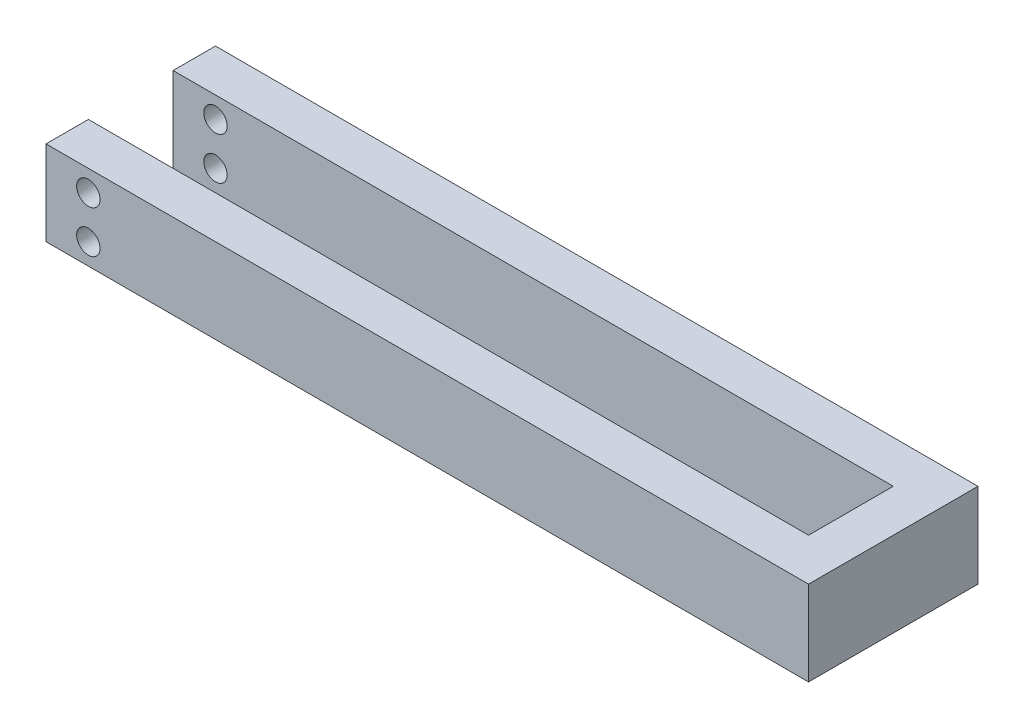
ISO-10303-21;
HEADER;
FILE_DESCRIPTION(('STEP AP214'),'2;1');
FILE_NAME('part.step','',(''),(''),'','','');
FILE_SCHEMA(('AUTOMOTIVE_DESIGN { 1 0 10303 214 1 1 1 1 }'));
ENDSEC;
DATA;
#1=APPLICATION_CONTEXT('core data for automotive mechanical design processes');
#2=APPLICATION_PROTOCOL_DEFINITION('international standard','automotive_design',2000,#1);
#3=PRODUCT_CONTEXT('',#1,'mechanical');
#4=PRODUCT('Part','Part','',(#3));
#5=PRODUCT_RELATED_PRODUCT_CATEGORY('part','',(#4));
#6=PRODUCT_DEFINITION_FORMATION('','',#4);
#7=PRODUCT_DEFINITION_CONTEXT('part definition',#1,'design');
#8=PRODUCT_DEFINITION('design','',#6,#7);
#9=PRODUCT_DEFINITION_SHAPE('','',#8);
#10=(LENGTH_UNIT() NAMED_UNIT(*) SI_UNIT(.MILLI.,.METRE.));
#11=(NAMED_UNIT(*) PLANE_ANGLE_UNIT() SI_UNIT($,.RADIAN.));
#12=(NAMED_UNIT(*) SI_UNIT($,.STERADIAN.) SOLID_ANGLE_UNIT());
#13=UNCERTAINTY_MEASURE_WITH_UNIT(LENGTH_MEASURE(1.E-05),#10,'distance_accuracy_value','');
#14=(GEOMETRIC_REPRESENTATION_CONTEXT(3) GLOBAL_UNCERTAINTY_ASSIGNED_CONTEXT((#13)) GLOBAL_UNIT_ASSIGNED_CONTEXT((#10,
#11,#12)) REPRESENTATION_CONTEXT('',''));
#15=CARTESIAN_POINT('',(0.,0.,0.));
#16=DIRECTION('',(0.,0.,1.));
#17=DIRECTION('',(1.,0.,0.));
#18=AXIS2_PLACEMENT_3D('',#15,#16,#17);
#19=CARTESIAN_POINT('',(-50.8,12.7,6.35));
#20=DIRECTION('',(1.,0.,0.));
#21=DIRECTION('',(0.,0.,-1.));
#22=AXIS2_PLACEMENT_3D('',#19,#20,#21);
#23=PLANE('',#22);
#24=DIRECTION('',(0.,0.,1.));
#25=VECTOR('',#24,1.);
#26=CARTESIAN_POINT('',(-50.8,0.,6.35));
#27=LINE('',#26,#25);
#28=CARTESIAN_POINT('',(-50.8,0.,6.35));
#29=VERTEX_POINT('',#28);
#30=CARTESIAN_POINT('',(-50.8,0.,12.7));
#31=VERTEX_POINT('',#30);
#32=EDGE_CURVE('E130',#29,#31,#27,.T.);
#33=ORIENTED_EDGE('',*,*,#32,.T.);
#34=DIRECTION('',(0.,-1.,0.));
#35=VECTOR('',#34,1.);
#36=CARTESIAN_POINT('',(-50.8,12.7,12.7));
#37=LINE('',#36,#35);
#38=CARTESIAN_POINT('',(-50.8,12.7,12.7));
#39=VERTEX_POINT('',#38);
#40=EDGE_CURVE('E11',#39,#31,#37,.T.);
#41=ORIENTED_EDGE('',*,*,#40,.F.);
#42=DIRECTION('',(0.,0.,1.));
#43=VECTOR('',#42,1.);
#44=CARTESIAN_POINT('',(-50.8,12.7,6.35));
#45=LINE('',#44,#43);
#46=CARTESIAN_POINT('',(-50.8,12.7,6.35));
#47=VERTEX_POINT('',#46);
#48=EDGE_CURVE('E148',#47,#39,#45,.T.);
#49=ORIENTED_EDGE('',*,*,#48,.F.);
#50=DIRECTION('',(0.,-1.,0.));
#51=VECTOR('',#50,1.);
#52=CARTESIAN_POINT('',(-50.8,12.7,6.35));
#53=LINE('',#52,#51);
#54=EDGE_CURVE('E126',#47,#29,#53,.T.);
#55=ORIENTED_EDGE('',*,*,#54,.T.);
#56=EDGE_LOOP('',(#33,#41,#49,#55));
#57=FACE_BOUND('',#56,.T.);
#58=ADVANCED_FACE('F32',(#57),#23,.F.);
#59=CARTESIAN_POINT('',(63.5,12.7,12.7));
#60=DIRECTION('',(0.,0.,-1.));
#61=DIRECTION('',(-1.,0.,0.));
#62=AXIS2_PLACEMENT_3D('',#59,#60,#61);
#63=PLANE('',#62);
#64=CARTESIAN_POINT('',(-44.45,3.175,12.7));
#65=DIRECTION('',(0.,0.,1.));
#66=DIRECTION('',(1.,0.,0.));
#67=AXIS2_PLACEMENT_3D('',#64,#65,#66);
#68=CIRCLE('',#67,1.7526);
#69=CARTESIAN_POINT('',(-42.6974,3.175,12.7));
#70=VERTEX_POINT('',#69);
#71=EDGE_CURVE('E348',#70,#70,#68,.T.);
#72=ORIENTED_EDGE('',*,*,#71,.F.);
#73=EDGE_LOOP('',(#72));
#74=FACE_BOUND('',#73,.T.);
#75=CARTESIAN_POINT('',(-44.45,9.525,12.7));
#76=DIRECTION('',(0.,0.,1.));
#77=DIRECTION('',(1.,0.,0.));
#78=AXIS2_PLACEMENT_3D('',#75,#76,#77);
#79=CIRCLE('',#78,1.7526);
#80=CARTESIAN_POINT('',(-42.6974,9.525,12.7));
#81=VERTEX_POINT('',#80);
#82=EDGE_CURVE('E167',#81,#81,#79,.T.);
#83=ORIENTED_EDGE('',*,*,#82,.F.);
#84=EDGE_LOOP('',(#83));
#85=FACE_BOUND('',#84,.T.);
#86=DIRECTION('',(1.,0.,0.));
#87=VECTOR('',#86,1.);
#88=CARTESIAN_POINT('',(63.5,0.,12.7));
#89=LINE('',#88,#87);
#90=CARTESIAN_POINT('',(63.5,0.,12.7));
#91=VERTEX_POINT('',#90);
#92=EDGE_CURVE('E133',#31,#91,#89,.T.);
#93=ORIENTED_EDGE('',*,*,#92,.T.);
#94=DIRECTION('',(0.,-1.,0.));
#95=VECTOR('',#94,1.);
#96=CARTESIAN_POINT('',(63.5,12.7,12.7));
#97=LINE('',#96,#95);
#98=CARTESIAN_POINT('',(63.5,12.7,12.7));
#99=VERTEX_POINT('',#98);
#100=EDGE_CURVE('E41',#99,#91,#97,.T.);
#101=ORIENTED_EDGE('',*,*,#100,.F.);
#102=DIRECTION('',(1.,0.,0.));
#103=VECTOR('',#102,1.);
#104=CARTESIAN_POINT('',(50.8,12.7,12.7));
#105=LINE('',#104,#103);
#106=EDGE_CURVE('E91',#39,#99,#105,.T.);
#107=ORIENTED_EDGE('',*,*,#106,.F.);
#108=ORIENTED_EDGE('',*,*,#40,.T.);
#109=EDGE_LOOP('',(#93,#101,#107,#108));
#110=FACE_BOUND('',#109,.T.);
#111=ADVANCED_FACE('F197',(#74,#85,#110),#63,.F.);
#112=CARTESIAN_POINT('',(63.5,12.7,-12.7));
#113=DIRECTION('',(-1.,0.,0.));
#114=DIRECTION('',(0.,0.,1.));
#115=AXIS2_PLACEMENT_3D('',#112,#113,#114);
#116=PLANE('',#115);
#117=DIRECTION('',(0.,0.,-1.));
#118=VECTOR('',#117,1.);
#119=CARTESIAN_POINT('',(63.5,0.,-12.7));
#120=LINE('',#119,#118);
#121=CARTESIAN_POINT('',(63.5,0.,-12.7));
#122=VERTEX_POINT('',#121);
#123=EDGE_CURVE('E136',#91,#122,#120,.T.);
#124=ORIENTED_EDGE('',*,*,#123,.T.);
#125=DIRECTION('',(0.,-1.,0.));
#126=VECTOR('',#125,1.);
#127=CARTESIAN_POINT('',(63.5,12.7,-12.7));
#128=LINE('',#127,#126);
#129=CARTESIAN_POINT('',(63.5,12.7,-12.7));
#130=VERTEX_POINT('',#129);
#131=EDGE_CURVE('E155',#130,#122,#128,.T.);
#132=ORIENTED_EDGE('',*,*,#131,.F.);
#133=DIRECTION('',(0.,0.,-1.));
#134=VECTOR('',#133,1.);
#135=CARTESIAN_POINT('',(63.5,12.7,-12.7));
#136=LINE('',#135,#134);
#137=EDGE_CURVE('E179',#99,#130,#136,.T.);
#138=ORIENTED_EDGE('',*,*,#137,.F.);
#139=ORIENTED_EDGE('',*,*,#100,.T.);
#140=EDGE_LOOP('',(#124,#132,#138,#139));
#141=FACE_BOUND('',#140,.T.);
#142=ADVANCED_FACE('F199',(#141),#116,.F.);
#143=CARTESIAN_POINT('',(50.8,12.7,-12.7));
#144=DIRECTION('',(0.,0.,1.));
#145=DIRECTION('',(1.,0.,0.));
#146=AXIS2_PLACEMENT_3D('',#143,#144,#145);
#147=PLANE('',#146);
#148=CARTESIAN_POINT('',(-44.45,3.175,-12.7));
#149=DIRECTION('',(0.,0.,1.));
#150=DIRECTION('',(1.,0.,0.));
#151=AXIS2_PLACEMENT_3D('',#148,#149,#150);
#152=CIRCLE('',#151,1.7526);
#153=CARTESIAN_POINT('',(-42.6974,3.175,-12.7));
#154=VERTEX_POINT('',#153);
#155=EDGE_CURVE('E343',#154,#154,#152,.T.);
#156=ORIENTED_EDGE('',*,*,#155,.T.);
#157=EDGE_LOOP('',(#156));
#158=FACE_BOUND('',#157,.T.);
#159=CARTESIAN_POINT('',(-44.45,9.525,-12.7));
#160=DIRECTION('',(0.,0.,1.));
#161=DIRECTION('',(1.,0.,0.));
#162=AXIS2_PLACEMENT_3D('',#159,#160,#161);
#163=CIRCLE('',#162,1.7526);
#164=CARTESIAN_POINT('',(-42.6974,9.525,-12.7));
#165=VERTEX_POINT('',#164);
#166=EDGE_CURVE('E161',#165,#165,#163,.T.);
#167=ORIENTED_EDGE('',*,*,#166,.T.);
#168=EDGE_LOOP('',(#167));
#169=FACE_BOUND('',#168,.T.);
#170=DIRECTION('',(-1.,0.,0.));
#171=VECTOR('',#170,1.);
#172=CARTESIAN_POINT('',(50.8,0.,-12.7));
#173=LINE('',#172,#171);
#174=CARTESIAN_POINT('',(-50.8,0.,-12.7));
#175=VERTEX_POINT('',#174);
#176=EDGE_CURVE('E139',#122,#175,#173,.T.);
#177=ORIENTED_EDGE('',*,*,#176,.T.);
#178=DIRECTION('',(0.,-1.,0.));
#179=VECTOR('',#178,1.);
#180=CARTESIAN_POINT('',(-50.8,12.7,-12.7));
#181=LINE('',#180,#179);
#182=CARTESIAN_POINT('',(-50.8,12.7,-12.7));
#183=VERTEX_POINT('',#182);
#184=EDGE_CURVE('E152',#183,#175,#181,.T.);
#185=ORIENTED_EDGE('',*,*,#184,.F.);
#186=DIRECTION('',(-1.,0.,0.));
#187=VECTOR('',#186,1.);
#188=CARTESIAN_POINT('',(50.8,12.7,-12.7));
#189=LINE('',#188,#187);
#190=EDGE_CURVE('E181',#130,#183,#189,.T.);
#191=ORIENTED_EDGE('',*,*,#190,.F.);
#192=ORIENTED_EDGE('',*,*,#131,.T.);
#193=EDGE_LOOP('',(#177,#185,#191,#192));
#194=FACE_BOUND('',#193,.T.);
#195=ADVANCED_FACE('F187',(#158,#169,#194),#147,.F.);
#196=CARTESIAN_POINT('',(-50.8,12.7,-12.7));
#197=DIRECTION('',(1.,0.,0.));
#198=DIRECTION('',(0.,0.,-1.));
#199=AXIS2_PLACEMENT_3D('',#196,#197,#198);
#200=PLANE('',#199);
#201=DIRECTION('',(0.,0.,1.));
#202=VECTOR('',#201,1.);
#203=CARTESIAN_POINT('',(-50.8,0.,-12.7));
#204=LINE('',#203,#202);
#205=CARTESIAN_POINT('',(-50.8,0.,-6.35));
#206=VERTEX_POINT('',#205);
#207=EDGE_CURVE('E141',#175,#206,#204,.T.);
#208=ORIENTED_EDGE('',*,*,#207,.T.);
#209=DIRECTION('',(0.,-1.,0.));
#210=VECTOR('',#209,1.);
#211=CARTESIAN_POINT('',(-50.8,12.7,-6.35));
#212=LINE('',#211,#210);
#213=CARTESIAN_POINT('',(-50.8,12.7,-6.35));
#214=VERTEX_POINT('',#213);
#215=EDGE_CURVE('E121',#214,#206,#212,.T.);
#216=ORIENTED_EDGE('',*,*,#215,.F.);
#217=DIRECTION('',(0.,0.,1.));
#218=VECTOR('',#217,1.);
#219=CARTESIAN_POINT('',(-50.8,12.7,-12.7));
#220=LINE('',#219,#218);
#221=EDGE_CURVE('E111',#183,#214,#220,.T.);
#222=ORIENTED_EDGE('',*,*,#221,.F.);
#223=ORIENTED_EDGE('',*,*,#184,.T.);
#224=EDGE_LOOP('',(#208,#216,#222,#223));
#225=FACE_BOUND('',#224,.T.);
#226=ADVANCED_FACE('F190',(#225),#200,.F.);
#227=CARTESIAN_POINT('',(44.45,12.7,-6.35000000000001));
#228=DIRECTION('',(0.,0.,-1.));
#229=DIRECTION('',(-1.,0.,0.));
#230=AXIS2_PLACEMENT_3D('',#227,#228,#229);
#231=PLANE('',#230);
#232=CARTESIAN_POINT('',(-44.45,3.175,-6.35000000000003));
#233=DIRECTION('',(0.,0.,-1.));
#234=DIRECTION('',(-1.,0.,0.));
#235=AXIS2_PLACEMENT_3D('',#232,#233,#234);
#236=CIRCLE('',#235,1.7526);
#237=CARTESIAN_POINT('',(-46.2026,3.175,-6.35000000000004));
#238=VERTEX_POINT('',#237);
#239=EDGE_CURVE('E172',#238,#238,#236,.T.);
#240=ORIENTED_EDGE('',*,*,#239,.T.);
#241=EDGE_LOOP('',(#240));
#242=FACE_BOUND('',#241,.T.);
#243=CARTESIAN_POINT('',(-44.45,9.525,-6.35000000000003));
#244=DIRECTION('',(0.,0.,-1.));
#245=DIRECTION('',(-1.,0.,0.));
#246=AXIS2_PLACEMENT_3D('',#243,#244,#245);
#247=CIRCLE('',#246,1.7526);
#248=CARTESIAN_POINT('',(-46.2026,9.525,-6.35000000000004));
#249=VERTEX_POINT('',#248);
#250=EDGE_CURVE('E134',#249,#249,#247,.T.);
#251=ORIENTED_EDGE('',*,*,#250,.T.);
#252=EDGE_LOOP('',(#251));
#253=FACE_BOUND('',#252,.T.);
#254=DIRECTION('',(1.,0.,0.));
#255=VECTOR('',#254,1.);
#256=CARTESIAN_POINT('',(44.45,0.,-6.35000000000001));
#257=LINE('',#256,#255);
#258=CARTESIAN_POINT('',(57.15,0.,-6.35000000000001));
#259=VERTEX_POINT('',#258);
#260=EDGE_CURVE('E119',#206,#259,#257,.T.);
#261=ORIENTED_EDGE('',*,*,#260,.T.);
#262=DIRECTION('',(0.,-1.,0.));
#263=VECTOR('',#262,1.);
#264=CARTESIAN_POINT('',(57.15,12.7,-6.35000000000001));
#265=LINE('',#264,#263);
#266=CARTESIAN_POINT('',(57.15,12.7,-6.35000000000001));
#267=VERTEX_POINT('',#266);
#268=EDGE_CURVE('E117',#267,#259,#265,.T.);
#269=ORIENTED_EDGE('',*,*,#268,.F.);
#270=DIRECTION('',(1.,0.,0.));
#271=VECTOR('',#270,1.);
#272=CARTESIAN_POINT('',(-44.45,12.7,-6.35));
#273=LINE('',#272,#271);
#274=EDGE_CURVE('E104',#214,#267,#273,.T.);
#275=ORIENTED_EDGE('',*,*,#274,.F.);
#276=ORIENTED_EDGE('',*,*,#215,.T.);
#277=EDGE_LOOP('',(#261,#269,#275,#276));
#278=FACE_BOUND('',#277,.T.);
#279=ADVANCED_FACE('F118',(#242,#253,#278),#231,.F.);
#280=CARTESIAN_POINT('',(57.15,12.7,6.34999999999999));
#281=DIRECTION('',(1.,0.,0.));
#282=DIRECTION('',(0.,0.,-1.));
#283=AXIS2_PLACEMENT_3D('',#280,#281,#282);
#284=PLANE('',#283);
#285=DIRECTION('',(0.,0.,1.));
#286=VECTOR('',#285,1.);
#287=CARTESIAN_POINT('',(57.15,0.,6.34999999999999));
#288=LINE('',#287,#286);
#289=CARTESIAN_POINT('',(57.15,0.,6.34999999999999));
#290=VERTEX_POINT('',#289);
#291=EDGE_CURVE('E145',#259,#290,#288,.T.);
#292=ORIENTED_EDGE('',*,*,#291,.T.);
#293=DIRECTION('',(0.,-1.,0.));
#294=VECTOR('',#293,1.);
#295=CARTESIAN_POINT('',(57.15,12.7,6.34999999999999));
#296=LINE('',#295,#294);
#297=CARTESIAN_POINT('',(57.15,12.7,6.34999999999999));
#298=VERTEX_POINT('',#297);
#299=EDGE_CURVE('E122',#298,#290,#296,.T.);
#300=ORIENTED_EDGE('',*,*,#299,.F.);
#301=DIRECTION('',(0.,0.,1.));
#302=VECTOR('',#301,1.);
#303=CARTESIAN_POINT('',(57.15,12.7,6.34999999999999));
#304=LINE('',#303,#302);
#305=EDGE_CURVE('E108',#267,#298,#304,.T.);
#306=ORIENTED_EDGE('',*,*,#305,.F.);
#307=ORIENTED_EDGE('',*,*,#268,.T.);
#308=EDGE_LOOP('',(#292,#300,#306,#307));
#309=FACE_BOUND('',#308,.T.);
#310=ADVANCED_FACE('F124',(#309),#284,.F.);
#311=CARTESIAN_POINT('',(-44.45,12.7,6.35));
#312=DIRECTION('',(0.,0.,1.));
#313=DIRECTION('',(1.,0.,0.));
#314=AXIS2_PLACEMENT_3D('',#311,#312,#313);
#315=PLANE('',#314);
#316=CARTESIAN_POINT('',(-44.45,3.175,6.35));
#317=DIRECTION('',(0.,0.,1.));
#318=DIRECTION('',(1.,0.,0.));
#319=AXIS2_PLACEMENT_3D('',#316,#317,#318);
#320=CIRCLE('',#319,1.7526);
#321=CARTESIAN_POINT('',(-42.6974,3.175,6.35));
#322=VERTEX_POINT('',#321);
#323=EDGE_CURVE('E35',#322,#322,#320,.T.);
#324=ORIENTED_EDGE('',*,*,#323,.T.);
#325=EDGE_LOOP('',(#324));
#326=FACE_BOUND('',#325,.T.);
#327=CARTESIAN_POINT('',(-44.45,9.525,6.35));
#328=DIRECTION('',(0.,0.,1.));
#329=DIRECTION('',(1.,0.,0.));
#330=AXIS2_PLACEMENT_3D('',#327,#328,#329);
#331=CIRCLE('',#330,1.7526);
#332=CARTESIAN_POINT('',(-42.6974,9.525,6.35));
#333=VERTEX_POINT('',#332);
#334=EDGE_CURVE('E159',#333,#333,#331,.T.);
#335=ORIENTED_EDGE('',*,*,#334,.T.);
#336=EDGE_LOOP('',(#335));
#337=FACE_BOUND('',#336,.T.);
#338=DIRECTION('',(-1.,0.,0.));
#339=VECTOR('',#338,1.);
#340=CARTESIAN_POINT('',(-44.45,0.,6.35));
#341=LINE('',#340,#339);
#342=EDGE_CURVE('E79',#290,#29,#341,.T.);
#343=ORIENTED_EDGE('',*,*,#342,.T.);
#344=ORIENTED_EDGE('',*,*,#54,.F.);
#345=DIRECTION('',(-1.,0.,0.));
#346=VECTOR('',#345,1.);
#347=CARTESIAN_POINT('',(44.45,12.7,6.34999999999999));
#348=LINE('',#347,#346);
#349=EDGE_CURVE('E50',#298,#47,#348,.T.);
#350=ORIENTED_EDGE('',*,*,#349,.F.);
#351=ORIENTED_EDGE('',*,*,#299,.T.);
#352=EDGE_LOOP('',(#343,#344,#350,#351));
#353=FACE_BOUND('',#352,.T.);
#354=ADVANCED_FACE('F193',(#326,#337,#353),#315,.F.);
#355=CARTESIAN_POINT('',(0.,12.7,0.));
#356=DIRECTION('',(0.,-1.,0.));
#357=DIRECTION('',(0.,0.,-1.));
#358=AXIS2_PLACEMENT_3D('',#355,#356,#357);
#359=PLANE('',#358);
#360=ORIENTED_EDGE('',*,*,#48,.T.);
#361=ORIENTED_EDGE('',*,*,#106,.T.);
#362=ORIENTED_EDGE('',*,*,#137,.T.);
#363=ORIENTED_EDGE('',*,*,#190,.T.);
#364=ORIENTED_EDGE('',*,*,#221,.T.);
#365=ORIENTED_EDGE('',*,*,#274,.T.);
#366=ORIENTED_EDGE('',*,*,#305,.T.);
#367=ORIENTED_EDGE('',*,*,#349,.T.);
#368=EDGE_LOOP('',(#360,#361,#362,#363,#364,#365,#366,#367));
#369=FACE_BOUND('',#368,.T.);
#370=ADVANCED_FACE('F106',(#369),#359,.F.);
#371=CARTESIAN_POINT('',(0.,0.,0.));
#372=DIRECTION('',(0.,-1.,0.));
#373=DIRECTION('',(0.,0.,-1.));
#374=AXIS2_PLACEMENT_3D('',#371,#372,#373);
#375=PLANE('',#374);
#376=ORIENTED_EDGE('',*,*,#32,.F.);
#377=ORIENTED_EDGE('',*,*,#342,.F.);
#378=ORIENTED_EDGE('',*,*,#291,.F.);
#379=ORIENTED_EDGE('',*,*,#260,.F.);
#380=ORIENTED_EDGE('',*,*,#207,.F.);
#381=ORIENTED_EDGE('',*,*,#176,.F.);
#382=ORIENTED_EDGE('',*,*,#123,.F.);
#383=ORIENTED_EDGE('',*,*,#92,.F.);
#384=EDGE_LOOP('',(#376,#377,#378,#379,#380,#381,#382,#383));
#385=FACE_BOUND('',#384,.T.);
#386=ADVANCED_FACE('F191',(#385),#375,.T.);
#387=CARTESIAN_POINT('',(-44.45,9.525,-12.7));
#388=DIRECTION('',(0.,0.,1.));
#389=DIRECTION('',(1.,0.,0.));
#390=AXIS2_PLACEMENT_3D('',#387,#388,#389);
#391=CYLINDRICAL_SURFACE('',#390,1.7526);
#392=ORIENTED_EDGE('',*,*,#82,.T.);
#393=EDGE_LOOP('',(#392));
#394=FACE_BOUND('',#393,.T.);
#395=ORIENTED_EDGE('',*,*,#334,.F.);
#396=EDGE_LOOP('',(#395));
#397=FACE_BOUND('',#396,.T.);
#398=ADVANCED_FACE('F261',(#394,#397),#391,.F.);
#399=ORIENTED_EDGE('',*,*,#166,.F.);
#400=EDGE_LOOP('',(#399));
#401=FACE_BOUND('',#400,.T.);
#402=ORIENTED_EDGE('',*,*,#250,.F.);
#403=EDGE_LOOP('',(#402));
#404=FACE_BOUND('',#403,.T.);
#405=ADVANCED_FACE('F266',(#401,#404),#391,.F.);
#406=CARTESIAN_POINT('',(-44.45,3.175,-12.7));
#407=DIRECTION('',(0.,0.,1.));
#408=DIRECTION('',(1.,0.,0.));
#409=AXIS2_PLACEMENT_3D('',#406,#407,#408);
#410=CYLINDRICAL_SURFACE('',#409,1.7526);
#411=ORIENTED_EDGE('',*,*,#71,.T.);
#412=EDGE_LOOP('',(#411));
#413=FACE_BOUND('',#412,.T.);
#414=ORIENTED_EDGE('',*,*,#323,.F.);
#415=EDGE_LOOP('',(#414));
#416=FACE_BOUND('',#415,.T.);
#417=ADVANCED_FACE('F276',(#413,#416),#410,.F.);
#418=ORIENTED_EDGE('',*,*,#155,.F.);
#419=EDGE_LOOP('',(#418));
#420=FACE_BOUND('',#419,.T.);
#421=ORIENTED_EDGE('',*,*,#239,.F.);
#422=EDGE_LOOP('',(#421));
#423=FACE_BOUND('',#422,.T.);
#424=ADVANCED_FACE('F285',(#420,#423),#410,.F.);
#425=CLOSED_SHELL('',(#58,#111,#142,#195,#226,#279,#310,#354,#370,#386,#398,#405,#417,#424));
#426=MANIFOLD_SOLID_BREP('B2',#425);
#427=ADVANCED_BREP_SHAPE_REPRESENTATION('',(#18,#426),#14);
#428=SHAPE_DEFINITION_REPRESENTATION(#9,#427);
ENDSEC;
END-ISO-10303-21;
